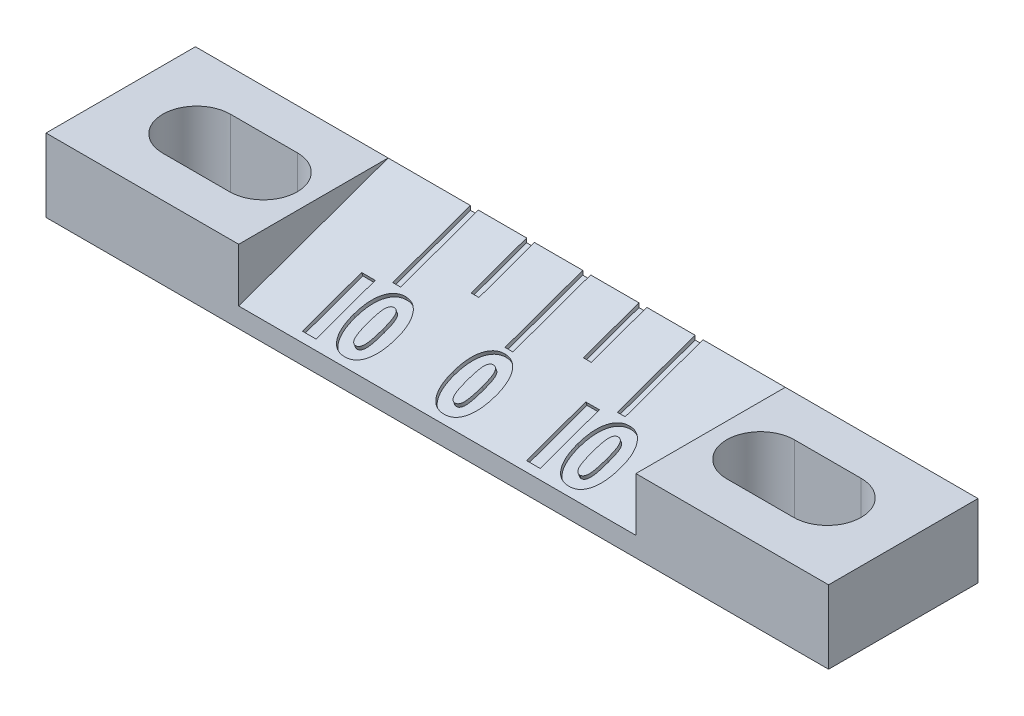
from build123d import *

# Parameters (mm, degrees)
SKETCH_1_W          = 25.273
SKETCH_1_H          = 4.826
EXTRUDE_1_DEPTH     = 2.3622
CUT_EXTRUDE_START   = -6.223
CUT_EXTRUDE_1_DEPTH = 12.827
SKETCH_3_W          = 0.254
SKETCH_3_H          = 2.667
SKETCH_3_H_2        = 1.905
SKETCH_3_W_2        = 0.439351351
SKETCH_3_H_3        = 2.032
CUT_EXTRUDE_2_DEPTH = 0.127


with BuildPart() as part:
    # Sketch 1 → Extrude 1 (new body)
    with BuildSketch(Plane(origin=(0, 0, 0), x_dir=(1, 0, 0), z_dir=(0, 1, 0))):
        with Locations((12.6365, 0)):
            Rectangle(SKETCH_1_W, SKETCH_1_H)
        with BuildLine():
            Line((2.4511, 1.0922), (4.6101, 1.0922))
            ThreePointArc((4.6101, 1.0922), (5.7023, 0), (4.6101, -1.0922))
            Line((4.6101, -1.0922), (2.4511, -1.0922))
            ThreePointArc((2.4511, -1.0922), (1.3589, 0), (2.4511, 1.0922))
        make_face(mode=Mode.SUBTRACT)
        with BuildLine():
            Line((20.6629, 1.0922), (22.8219, 1.0922))
            ThreePointArc((22.8219, 1.0922), (23.9141, 0), (22.8219, -1.0922))
            Line((22.8219, -1.0922), (20.6629, -1.0922))
            ThreePointArc((20.6629, -1.0922), (19.5707, 0), (20.6629, 1.0922))
        make_face(mode=Mode.SUBTRACT)
    extrude(amount=EXTRUDE_1_DEPTH)

    # Sketch 2 → Cut-Extrude 1 (cut)
    with BuildSketch(Plane.ZY.offset(CUT_EXTRUDE_START)):
        Polygon((-2.413, 2.3622), (2.413, 2.3622), (2.413, 0.635), align=None)
    extrude(amount=-CUT_EXTRUDE_1_DEPTH, mode=Mode.SUBTRACT)

    # Sketch 3 → Cut-Extrude 2 (cut)
    # profile 1 of 10: a face of its own
    with BuildSketch(Plane(origin=(0, 1.328441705, 0.475442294), x_dir=(1, 0, 0), z_dir=(0, 0.941517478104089, 0.33696415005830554))):
        with Locations((9.00938, 1.73435839)):
            Rectangle(SKETCH_3_W, SKETCH_3_H)
    # profile 2 of 10: a face of its own
    with BuildSketch(Plane(origin=(0, 1.328441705, 0.475442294), x_dir=(1, 0, 0), z_dir=(0, 0.941517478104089, 0.33696415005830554))):
        with Locations((10.82294, 2.11535839)):
            Rectangle(SKETCH_3_W, SKETCH_3_H_2)
    # profile 3 of 10: a face of its own
    with BuildSketch(Plane(origin=(0, 1.328441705, 0.475442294), x_dir=(1, 0, 0), z_dir=(0, 0.941517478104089, 0.33696415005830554))):
        with Locations((12.6365, 1.73435839)):
            Rectangle(SKETCH_3_W, SKETCH_3_H)
    # profile 4 of 10: a face of its own
    with BuildSketch(Plane(origin=(0, 1.328441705, 0.475442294), x_dir=(1, 0, 0), z_dir=(0, 0.941517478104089, 0.33696415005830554))):
        with Locations((14.45006, 2.11535839)):
            Rectangle(SKETCH_3_W, SKETCH_3_H_2)
    # profile 5 of 10: a face of its own
    with BuildSketch(Plane(origin=(0, 1.328441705, 0.475442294), x_dir=(1, 0, 0), z_dir=(0, 0.941517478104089, 0.33696415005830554))):
        with Locations((16.26362, 1.73435839)):
            Rectangle(SKETCH_3_W, SKETCH_3_H)
    # profile 6 of 10: a face of its own
    with BuildSketch(Plane(origin=(0, 1.328441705, 0.475442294), x_dir=(1, 0, 0), z_dir=(0, 0.941517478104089, 0.33696415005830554))):
        with Locations((8.260651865, -0.787909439)):
            Rectangle(SKETCH_3_W_2, SKETCH_3_H_3)
    # profile 7 of 10: a face of its own
    with BuildSketch(Plane(origin=(0, 1.328441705, 0.475442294), x_dir=(1, 0, 0), z_dir=(0, 0.941517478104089, 0.33696415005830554))):
        with BuildLine():
            add(Edge.make_bspline(
                [(9.429223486, 0.25555002), (9.455316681, 0.254813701), (9.506428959, 0.253371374), (9.580591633, 0.239489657), (9.650662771, 0.218134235), (9.716337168, 0.187526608), (9.777127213, 0.147574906), (9.833572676, 0.099236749), (9.885601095, 0.042345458), (9.932443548, -0.023237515), (9.975057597, -0.095587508), (10.011155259, -0.175073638), (10.042813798, -0.260247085), (10.067833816, -0.352068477), (10.087433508, -0.44999315), (10.101562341, -0.554015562), (10.109571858, -0.664215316), (10.110792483, -0.73969944), (10.111419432, -0.77847025)],
                knots=[0, 0, 0, 0, 0.901619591, 1.766124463, 2.600030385, 3.429877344, 4.262667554, 5.108228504, 5.99398226, 6.922079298, 7.890910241, 8.893487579, 9.937338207, 11.03061383, 12.181138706, 13.389268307, 14.659053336, 16, 16, 16, 16], degree=3))
            add(Edge.make_bspline(
                [(10.111419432, -0.77847025), (10.111028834, -0.818675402), (10.110267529, -0.897038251), (10.101387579, -1.011028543), (10.087765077, -1.118303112), (10.069351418, -1.218940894), (10.044289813, -1.312628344), (10.014491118, -1.399721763), (9.97890301, -1.479951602), (9.937698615, -1.552845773), (9.892217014, -1.618677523), (9.840519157, -1.675075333), (9.785109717, -1.724064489), (9.723966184, -1.763098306), (9.658635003, -1.794182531), (9.588154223, -1.815325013), (9.513290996, -1.829190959), (9.461609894, -1.830632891), (9.435230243, -1.831368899)],
                knots=[0, 0, 0, 0, 1.373484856, 2.677024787, 3.903828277, 5.067363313, 6.169730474, 7.214440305, 8.209763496, 9.16381591, 10.072183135, 10.937038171, 11.771868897, 12.591937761, 13.407334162, 14.235833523, 15.099514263, 16, 16, 16, 16], degree=3))
            add(Edge.make_bspline(
                [(9.435230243, -1.831368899), (9.408437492, -1.83056437), (9.355959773, -1.828988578), (9.279592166, -1.81607985), (9.208102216, -1.793822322), (9.140814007, -1.763737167), (9.078294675, -1.72444692), (9.020774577, -1.676070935), (8.967749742, -1.619495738), (8.919794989, -1.554408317), (8.87714197, -1.481808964), (8.839581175, -1.402483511), (8.808453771, -1.316183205), (8.782878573, -1.223341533), (8.762684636, -1.124012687), (8.748864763, -1.018055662), (8.740140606, -0.905616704), (8.739021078, -0.828400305), (8.738446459, -0.788767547)],
                knots=[0, 0, 0, 0, 0.912813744, 1.78788596, 2.629703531, 3.458708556, 4.293155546, 5.137565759, 6.01346571, 6.929864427, 7.887046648, 8.87913817, 9.91692594, 11.009659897, 12.15871453, 13.368555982, 14.649362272, 16, 16, 16, 16], degree=3))
            add(Edge.make_bspline(
                [(8.738446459, -0.788767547), (8.739035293, -0.748707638), (8.740182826, -0.670637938), (8.748708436, -0.557012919), (8.763157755, -0.45008647), (8.783605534, -0.350148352), (8.80973466, -0.257037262), (8.841341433, -0.170767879), (8.879099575, -0.091363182), (8.922860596, -0.019343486), (8.971181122, 0.045295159), (9.024179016, 0.101603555), (9.081560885, 0.14913671), (9.143015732, 0.188287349), (9.208730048, 0.21848009), (9.278525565, 0.240013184), (9.352494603, 0.253229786), (9.403281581, 0.254765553), (9.429223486, 0.25555002)],
                knots=[0, 0, 0, 0, 1.370227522, 2.67033187, 3.894931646, 5.058736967, 6.156769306, 7.200023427, 8.197828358, 9.159330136, 10.078076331, 10.953605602, 11.797964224, 12.620426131, 13.439096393, 14.26383943, 15.113172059, 16, 16, 16, 16], degree=3))
        make_face()
        with BuildLine():
            add(Edge.make_bspline(
                [(9.428794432, -1.446936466), (9.437996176, -1.446587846), (9.455960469, -1.445907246), (9.481879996, -1.438655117), (9.50583085, -1.427003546), (9.527455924, -1.410301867), (9.547042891, -1.389222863), (9.564608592, -1.363553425), (9.580373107, -1.333445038), (9.594344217, -1.298235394), (9.606219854, -1.25667534), (9.616998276, -1.207716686), (9.625046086, -1.15044523), (9.632450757, -1.08536519), (9.637702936, -1.012069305), (9.642204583, -0.930835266), (9.64399868, -0.841405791), (9.644399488, -0.7791854), (9.644608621, -0.74672025)],
                knots=[0, 0, 0, 0, 0.554780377, 1.083081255, 1.612582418, 2.155317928, 2.723926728, 3.344836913, 4.029093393, 4.773720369, 5.629638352, 6.638250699, 7.800574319, 9.122365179, 10.595813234, 12.240086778, 14.038164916, 16, 16, 16, 16], degree=3))
            add(Edge.make_bspline(
                [(9.644608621, -0.74672025), (9.644393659, -0.719547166), (9.643980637, -0.667337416), (9.642250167, -0.592053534), (9.637474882, -0.523010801), (9.632989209, -0.459953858), (9.625449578, -0.403326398), (9.617144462, -0.352854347), (9.60696472, -0.308527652), (9.595080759, -0.270007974), (9.581154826, -0.236653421), (9.565464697, -0.20793058), (9.547761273, -0.183236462), (9.527567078, -0.163353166), (9.505098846, -0.148027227), (9.480882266, -0.136558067), (9.454157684, -0.130052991), (9.435693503, -0.129279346), (9.426220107, -0.128882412)],
                knots=[0, 0, 0, 0, 1.818826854, 3.494652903, 5.038753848, 6.450554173, 7.724525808, 8.860723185, 9.873075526, 10.766171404, 11.555518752, 12.288154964, 12.952512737, 13.582028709, 14.174116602, 14.765120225, 15.366421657, 16, 16, 16, 16], degree=3))
            add(Edge.make_bspline(
                [(9.426220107, -0.128882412), (9.41688442, -0.12926853), (9.39869212, -0.130020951), (9.372512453, -0.136661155), (9.348421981, -0.147606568), (9.326294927, -0.162940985), (9.305953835, -0.182435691), (9.287944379, -0.206518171), (9.271594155, -0.234546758), (9.25721701, -0.267645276), (9.244713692, -0.307010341), (9.234436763, -0.354026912), (9.224758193, -0.409228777), (9.218120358, -0.473046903), (9.211794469, -0.545110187), (9.208444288, -0.625561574), (9.205635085, -0.714378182), (9.205387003, -0.776465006), (9.20525727, -0.808933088)],
                knots=[0, 0, 0, 0, 0.574082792, 1.118705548, 1.650723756, 2.195417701, 2.768418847, 3.377818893, 4.040849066, 4.762406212, 5.595076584, 6.579856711, 7.723556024, 9.044166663, 10.528707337, 12.177340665, 14.00095405, 16, 16, 16, 16], degree=3))
            add(Edge.make_bspline(
                [(9.20525727, -0.808933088), (9.205388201, -0.836396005), (9.205639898, -0.889189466), (9.208488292, -0.965419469), (9.211819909, -1.035581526), (9.218197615, -1.099772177), (9.224963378, -1.158137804), (9.234541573, -1.21034088), (9.245070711, -1.256697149), (9.257410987, -1.297192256), (9.271517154, -1.332516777), (9.287931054, -1.362892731), (9.306135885, -1.388805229), (9.326742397, -1.409894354), (9.349205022, -1.426642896), (9.374093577, -1.438106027), (9.400708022, -1.446044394), (9.419295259, -1.446634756), (9.428794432, -1.446936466)],
                knots=[0, 0, 0, 0, 1.788853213, 3.438809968, 4.969004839, 6.363268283, 7.64016425, 8.79510204, 9.818808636, 10.735282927, 11.550138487, 12.29218564, 12.979900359, 13.605768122, 14.205793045, 14.793393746, 15.383353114, 16, 16, 16, 16], degree=3))
        make_face(mode=Mode.SUBTRACT)
    # profile 8 of 10: a face of its own
    with BuildSketch(Plane(origin=(0, 1.328441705, 0.475442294), x_dir=(1, 0, 0), z_dir=(0, 0.941517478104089, 0.33696415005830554))):
        with BuildLine():
            add(Edge.make_bspline(
                [(12.636488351, 0.25555002), (12.662581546, 0.254813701), (12.713693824, 0.253371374), (12.787856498, 0.239489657), (12.857927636, 0.218134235), (12.923602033, 0.187526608), (12.984392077, 0.147574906), (13.040837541, 0.099236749), (13.09286596, 0.042345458), (13.139708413, -0.023237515), (13.182322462, -0.095587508), (13.218420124, -0.175073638), (13.250078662, -0.260247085), (13.275098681, -0.352068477), (13.294698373, -0.44999315), (13.308827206, -0.554015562), (13.316836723, -0.664215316), (13.318057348, -0.73969944), (13.318684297, -0.77847025)],
                knots=[0, 0, 0, 0, 0.901619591, 1.766124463, 2.600030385, 3.429877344, 4.262667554, 5.108228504, 5.99398226, 6.922079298, 7.890910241, 8.893487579, 9.937338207, 11.03061383, 12.181138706, 13.389268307, 14.659053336, 16, 16, 16, 16], degree=3))
            add(Edge.make_bspline(
                [(13.318684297, -0.77847025), (13.318293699, -0.818675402), (13.317532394, -0.897038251), (13.308652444, -1.011028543), (13.295029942, -1.118303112), (13.276616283, -1.218940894), (13.251554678, -1.312628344), (13.221755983, -1.399721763), (13.186167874, -1.479951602), (13.144963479, -1.552845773), (13.099481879, -1.618677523), (13.047784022, -1.675075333), (12.992374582, -1.724064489), (12.931231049, -1.763098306), (12.865899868, -1.794182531), (12.795419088, -1.815325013), (12.720555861, -1.829190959), (12.668874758, -1.830632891), (12.642495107, -1.831368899)],
                knots=[0, 0, 0, 0, 1.373484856, 2.677024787, 3.903828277, 5.067363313, 6.169730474, 7.214440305, 8.209763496, 9.16381591, 10.072183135, 10.937038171, 11.771868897, 12.591937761, 13.407334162, 14.235833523, 15.099514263, 16, 16, 16, 16], degree=3))
            add(Edge.make_bspline(
                [(12.642495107, -1.831368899), (12.615702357, -1.83056437), (12.563224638, -1.828988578), (12.486857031, -1.81607985), (12.415367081, -1.793822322), (12.348078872, -1.763737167), (12.285559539, -1.72444692), (12.228039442, -1.676070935), (12.175014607, -1.619495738), (12.127059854, -1.554408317), (12.084406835, -1.481808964), (12.04684604, -1.402483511), (12.015718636, -1.316183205), (11.990143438, -1.223341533), (11.969949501, -1.124012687), (11.956129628, -1.018055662), (11.947405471, -0.905616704), (11.946285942, -0.828400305), (11.945711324, -0.788767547)],
                knots=[0, 0, 0, 0, 0.912813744, 1.78788596, 2.629703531, 3.458708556, 4.293155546, 5.137565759, 6.01346571, 6.929864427, 7.887046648, 8.87913817, 9.91692594, 11.009659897, 12.15871453, 13.368555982, 14.649362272, 16, 16, 16, 16], degree=3))
            add(Edge.make_bspline(
                [(11.945711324, -0.788767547), (11.946300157, -0.748707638), (11.947447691, -0.670637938), (11.955973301, -0.557012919), (11.97042262, -0.45008647), (11.990870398, -0.350148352), (12.016999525, -0.257037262), (12.048606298, -0.170767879), (12.08636444, -0.091363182), (12.13012546, -0.019343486), (12.178445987, 0.045295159), (12.231443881, 0.101603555), (12.28882575, 0.14913671), (12.350280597, 0.188287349), (12.415994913, 0.21848009), (12.48579043, 0.240013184), (12.559759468, 0.253229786), (12.610546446, 0.254765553), (12.636488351, 0.25555002)],
                knots=[0, 0, 0, 0, 1.370227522, 2.67033187, 3.894931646, 5.058736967, 6.156769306, 7.200023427, 8.197828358, 9.159330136, 10.078076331, 10.953605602, 11.797964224, 12.620426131, 13.439096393, 14.26383943, 15.113172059, 16, 16, 16, 16], degree=3))
        make_face()
        with BuildLine():
            add(Edge.make_bspline(
                [(12.636059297, -1.446936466), (12.645261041, -1.446587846), (12.663225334, -1.445907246), (12.689144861, -1.438655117), (12.713095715, -1.427003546), (12.734720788, -1.410301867), (12.754307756, -1.389222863), (12.771873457, -1.363553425), (12.787637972, -1.333445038), (12.801609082, -1.298235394), (12.813484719, -1.25667534), (12.824263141, -1.207716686), (12.832310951, -1.15044523), (12.839715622, -1.08536519), (12.844967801, -1.012069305), (12.849469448, -0.930835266), (12.851263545, -0.841405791), (12.851664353, -0.7791854), (12.851873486, -0.74672025)],
                knots=[0, 0, 0, 0, 0.554780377, 1.083081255, 1.612582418, 2.155317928, 2.723926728, 3.344836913, 4.029093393, 4.773720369, 5.629638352, 6.638250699, 7.800574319, 9.122365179, 10.595813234, 12.240086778, 14.038164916, 16, 16, 16, 16], degree=3))
            add(Edge.make_bspline(
                [(12.851873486, -0.74672025), (12.851658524, -0.719547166), (12.851245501, -0.667337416), (12.849515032, -0.592053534), (12.844739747, -0.523010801), (12.840254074, -0.459953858), (12.832714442, -0.403326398), (12.824409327, -0.352854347), (12.814229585, -0.308527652), (12.802345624, -0.270007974), (12.788419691, -0.236653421), (12.772729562, -0.20793058), (12.755026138, -0.183236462), (12.734831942, -0.163353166), (12.712363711, -0.148027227), (12.68814713, -0.136558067), (12.661422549, -0.130052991), (12.642958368, -0.129279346), (12.633484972, -0.128882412)],
                knots=[0, 0, 0, 0, 1.818826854, 3.494652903, 5.038753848, 6.450554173, 7.724525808, 8.860723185, 9.873075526, 10.766171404, 11.555518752, 12.288154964, 12.952512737, 13.582028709, 14.174116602, 14.765120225, 15.366421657, 16, 16, 16, 16], degree=3))
            add(Edge.make_bspline(
                [(12.633484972, -0.128882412), (12.624149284, -0.12926853), (12.605956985, -0.130020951), (12.579777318, -0.136661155), (12.555686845, -0.147606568), (12.533559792, -0.162940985), (12.5132187, -0.182435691), (12.495209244, -0.206518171), (12.478859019, -0.234546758), (12.464481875, -0.267645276), (12.451978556, -0.307010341), (12.441701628, -0.354026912), (12.432023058, -0.409228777), (12.425385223, -0.473046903), (12.419059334, -0.545110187), (12.415709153, -0.625561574), (12.41289995, -0.714378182), (12.412651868, -0.776465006), (12.412522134, -0.808933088)],
                knots=[0, 0, 0, 0, 0.574082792, 1.118705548, 1.650723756, 2.195417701, 2.768418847, 3.377818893, 4.040849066, 4.762406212, 5.595076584, 6.579856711, 7.723556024, 9.044166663, 10.528707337, 12.177340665, 14.00095405, 16, 16, 16, 16], degree=3))
            add(Edge.make_bspline(
                [(12.412522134, -0.808933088), (12.412653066, -0.836396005), (12.412904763, -0.889189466), (12.415753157, -0.965419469), (12.419084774, -1.035581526), (12.42546248, -1.099772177), (12.432228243, -1.158137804), (12.441806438, -1.21034088), (12.452335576, -1.256697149), (12.464675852, -1.297192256), (12.478782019, -1.332516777), (12.495195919, -1.362892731), (12.51340075, -1.388805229), (12.534007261, -1.409894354), (12.556469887, -1.426642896), (12.581358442, -1.438106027), (12.607972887, -1.446044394), (12.626560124, -1.446634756), (12.636059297, -1.446936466)],
                knots=[0, 0, 0, 0, 1.788853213, 3.438809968, 4.969004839, 6.363268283, 7.64016425, 8.79510204, 9.818808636, 10.735282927, 11.550138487, 12.29218564, 12.979900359, 13.605768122, 14.205793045, 14.793393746, 15.383353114, 16, 16, 16, 16], degree=3))
        make_face(mode=Mode.SUBTRACT)
    # profile 9 of 10: a face of its own
    with BuildSketch(Plane(origin=(0, 1.328441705, 0.475442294), x_dir=(1, 0, 0), z_dir=(0, 0.941517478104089, 0.33696415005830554))):
        with Locations((15.498965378, -0.787909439)):
            Rectangle(SKETCH_3_W_2, SKETCH_3_H_3)
    # profile 10 of 10: a face of its own
    with BuildSketch(Plane(origin=(0, 1.328441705, 0.475442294), x_dir=(1, 0, 0), z_dir=(0, 0.941517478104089, 0.33696415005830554))):
        with BuildLine():
            add(Edge.make_bspline(
                [(16.667536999, 0.25555002), (16.693630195, 0.254813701), (16.744742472, 0.253371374), (16.818905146, 0.239489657), (16.888976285, 0.218134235), (16.954650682, 0.187526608), (17.015440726, 0.147574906), (17.071886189, 0.099236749), (17.123914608, 0.042345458), (17.170757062, -0.023237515), (17.213371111, -0.095587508), (17.249468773, -0.175073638), (17.281127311, -0.260247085), (17.30614733, -0.352068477), (17.325747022, -0.44999315), (17.339875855, -0.554015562), (17.347885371, -0.664215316), (17.349105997, -0.73969944), (17.349732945, -0.77847025)],
                knots=[0, 0, 0, 0, 0.901619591, 1.766124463, 2.600030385, 3.429877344, 4.262667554, 5.108228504, 5.99398226, 6.922079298, 7.890910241, 8.893487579, 9.937338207, 11.03061383, 12.181138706, 13.389268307, 14.659053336, 16, 16, 16, 16], degree=3))
            add(Edge.make_bspline(
                [(17.349732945, -0.77847025), (17.349342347, -0.818675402), (17.348581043, -0.897038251), (17.339701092, -1.011028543), (17.326078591, -1.118303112), (17.307664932, -1.218940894), (17.282603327, -1.312628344), (17.252804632, -1.399721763), (17.217216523, -1.479951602), (17.176012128, -1.552845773), (17.130530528, -1.618677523), (17.07883267, -1.675075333), (17.02342323, -1.724064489), (16.962279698, -1.763098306), (16.896948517, -1.794182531), (16.826467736, -1.815325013), (16.75160451, -1.829190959), (16.699923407, -1.830632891), (16.673543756, -1.831368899)],
                knots=[0, 0, 0, 0, 1.373484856, 2.677024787, 3.903828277, 5.067363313, 6.169730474, 7.214440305, 8.209763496, 9.16381591, 10.072183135, 10.937038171, 11.771868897, 12.591937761, 13.407334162, 14.235833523, 15.099514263, 16, 16, 16, 16], degree=3))
            add(Edge.make_bspline(
                [(16.673543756, -1.831368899), (16.646751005, -1.83056437), (16.594273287, -1.828988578), (16.51790568, -1.81607985), (16.446415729, -1.793822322), (16.37912752, -1.763737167), (16.316608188, -1.72444692), (16.259088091, -1.676070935), (16.206063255, -1.619495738), (16.158108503, -1.554408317), (16.115455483, -1.481808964), (16.077894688, -1.402483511), (16.046767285, -1.316183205), (16.021192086, -1.223341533), (16.000998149, -1.124012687), (15.987178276, -1.018055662), (15.978454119, -0.905616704), (15.977334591, -0.828400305), (15.976759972, -0.788767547)],
                knots=[0, 0, 0, 0, 0.912813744, 1.78788596, 2.629703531, 3.458708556, 4.293155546, 5.137565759, 6.01346571, 6.929864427, 7.887046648, 8.87913817, 9.91692594, 11.009659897, 12.15871453, 13.368555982, 14.649362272, 16, 16, 16, 16], degree=3))
            add(Edge.make_bspline(
                [(15.976759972, -0.788767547), (15.977348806, -0.748707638), (15.978496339, -0.670637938), (15.987021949, -0.557012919), (16.001471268, -0.45008647), (16.021919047, -0.350148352), (16.048048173, -0.257037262), (16.079654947, -0.170767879), (16.117413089, -0.091363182), (16.161174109, -0.019343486), (16.209494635, 0.045295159), (16.26249253, 0.101603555), (16.319874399, 0.14913671), (16.381329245, 0.188287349), (16.447043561, 0.21848009), (16.516839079, 0.240013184), (16.590808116, 0.253229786), (16.641595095, 0.254765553), (16.667536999, 0.25555002)],
                knots=[0, 0, 0, 0, 1.370227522, 2.67033187, 3.894931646, 5.058736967, 6.156769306, 7.200023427, 8.197828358, 9.159330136, 10.078076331, 10.953605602, 11.797964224, 12.620426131, 13.439096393, 14.26383943, 15.113172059, 16, 16, 16, 16], degree=3))
        make_face()
        with BuildLine():
            add(Edge.make_bspline(
                [(16.667107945, -1.446936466), (16.67630969, -1.446587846), (16.694273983, -1.445907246), (16.720193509, -1.438655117), (16.744144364, -1.427003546), (16.765769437, -1.410301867), (16.785356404, -1.389222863), (16.802922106, -1.363553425), (16.818686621, -1.333445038), (16.832657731, -1.298235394), (16.844533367, -1.25667534), (16.85531179, -1.207716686), (16.8633596, -1.15044523), (16.870764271, -1.08536519), (16.876016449, -1.012069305), (16.880518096, -0.930835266), (16.882312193, -0.841405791), (16.882713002, -0.7791854), (16.882922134, -0.74672025)],
                knots=[0, 0, 0, 0, 0.554780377, 1.083081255, 1.612582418, 2.155317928, 2.723926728, 3.344836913, 4.029093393, 4.773720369, 5.629638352, 6.638250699, 7.800574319, 9.122365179, 10.595813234, 12.240086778, 14.038164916, 16, 16, 16, 16], degree=3))
            add(Edge.make_bspline(
                [(16.882922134, -0.74672025), (16.882707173, -0.719547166), (16.88229415, -0.667337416), (16.880563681, -0.592053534), (16.875788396, -0.523010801), (16.871302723, -0.459953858), (16.863763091, -0.403326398), (16.855457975, -0.352854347), (16.845278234, -0.308527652), (16.833394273, -0.270007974), (16.819468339, -0.236653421), (16.803778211, -0.20793058), (16.786074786, -0.183236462), (16.765880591, -0.163353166), (16.743412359, -0.148027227), (16.719195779, -0.136558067), (16.692471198, -0.130052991), (16.674007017, -0.129279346), (16.664533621, -0.128882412)],
                knots=[0, 0, 0, 0, 1.818826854, 3.494652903, 5.038753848, 6.450554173, 7.724525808, 8.860723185, 9.873075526, 10.766171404, 11.555518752, 12.288154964, 12.952512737, 13.582028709, 14.174116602, 14.765120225, 15.366421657, 16, 16, 16, 16], degree=3))
            add(Edge.make_bspline(
                [(16.664533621, -0.128882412), (16.655197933, -0.12926853), (16.637005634, -0.130020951), (16.610825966, -0.136661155), (16.586735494, -0.147606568), (16.564608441, -0.162940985), (16.544267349, -0.182435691), (16.526257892, -0.206518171), (16.509907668, -0.234546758), (16.495530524, -0.267645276), (16.483027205, -0.307010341), (16.472750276, -0.354026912), (16.463071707, -0.409228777), (16.456433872, -0.473046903), (16.450107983, -0.545110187), (16.446757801, -0.625561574), (16.443948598, -0.714378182), (16.443700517, -0.776465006), (16.443570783, -0.808933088)],
                knots=[0, 0, 0, 0, 0.574082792, 1.118705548, 1.650723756, 2.195417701, 2.768418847, 3.377818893, 4.040849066, 4.762406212, 5.595076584, 6.579856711, 7.723556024, 9.044166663, 10.528707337, 12.177340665, 14.00095405, 16, 16, 16, 16], degree=3))
            add(Edge.make_bspline(
                [(16.443570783, -0.808933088), (16.443701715, -0.836396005), (16.443953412, -0.889189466), (16.446801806, -0.965419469), (16.450133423, -1.035581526), (16.456511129, -1.099772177), (16.463276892, -1.158137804), (16.472855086, -1.21034088), (16.483384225, -1.256697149), (16.4957245, -1.297192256), (16.509830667, -1.332516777), (16.526244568, -1.362892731), (16.544449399, -1.388805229), (16.56505591, -1.409894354), (16.587518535, -1.426642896), (16.612407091, -1.438106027), (16.639021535, -1.446044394), (16.657608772, -1.446634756), (16.667107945, -1.446936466)],
                knots=[0, 0, 0, 0, 1.788853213, 3.438809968, 4.969004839, 6.363268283, 7.64016425, 8.79510204, 9.818808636, 10.735282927, 11.550138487, 12.29218564, 12.979900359, 13.605768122, 14.205793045, 14.793393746, 15.383353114, 16, 16, 16, 16], degree=3))
        make_face(mode=Mode.SUBTRACT)
    extrude(amount=-CUT_EXTRUDE_2_DEPTH, mode=Mode.SUBTRACT)


solid = part.part
